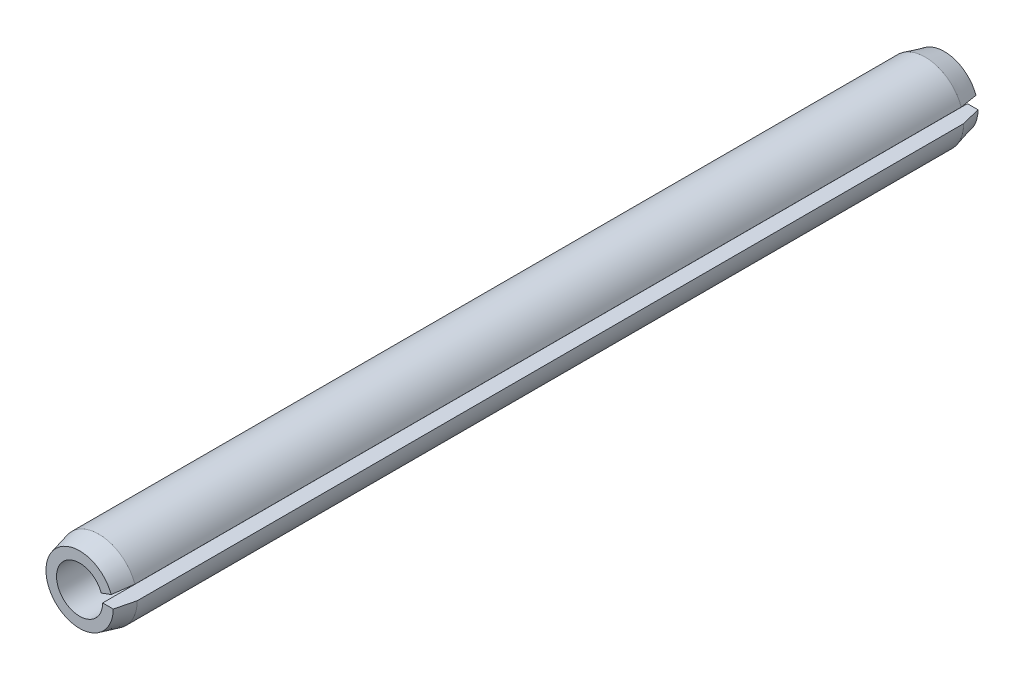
ISO-10303-21;
HEADER;
FILE_DESCRIPTION(('STEP AP214'),'2;1');
FILE_NAME('part.step','',(''),(''),'','','');
FILE_SCHEMA(('AUTOMOTIVE_DESIGN { 1 0 10303 214 1 1 1 1 }'));
ENDSEC;
DATA;
#1=APPLICATION_CONTEXT('core data for automotive mechanical design processes');
#2=APPLICATION_PROTOCOL_DEFINITION('international standard','automotive_design',2000,#1);
#3=PRODUCT_CONTEXT('',#1,'mechanical');
#4=PRODUCT('Part','Part','',(#3));
#5=PRODUCT_RELATED_PRODUCT_CATEGORY('part','',(#4));
#6=PRODUCT_DEFINITION_FORMATION('','',#4);
#7=PRODUCT_DEFINITION_CONTEXT('part definition',#1,'design');
#8=PRODUCT_DEFINITION('design','',#6,#7);
#9=PRODUCT_DEFINITION_SHAPE('','',#8);
#10=(LENGTH_UNIT() NAMED_UNIT(*) SI_UNIT(.MILLI.,.METRE.));
#11=(NAMED_UNIT(*) PLANE_ANGLE_UNIT() SI_UNIT($,.RADIAN.));
#12=(NAMED_UNIT(*) SI_UNIT($,.STERADIAN.) SOLID_ANGLE_UNIT());
#13=UNCERTAINTY_MEASURE_WITH_UNIT(LENGTH_MEASURE(1.E-05),#10,'distance_accuracy_value','');
#14=(GEOMETRIC_REPRESENTATION_CONTEXT(3) GLOBAL_UNCERTAINTY_ASSIGNED_CONTEXT((#13)) GLOBAL_UNIT_ASSIGNED_CONTEXT((#10,
#11,#12)) REPRESENTATION_CONTEXT('',''));
#15=CARTESIAN_POINT('',(0.,0.,0.));
#16=DIRECTION('',(0.,0.,1.));
#17=DIRECTION('',(1.,0.,0.));
#18=AXIS2_PLACEMENT_3D('',#15,#16,#17);
#19=CARTESIAN_POINT('',(0.,0.,45.));
#20=DIRECTION('',(0.,0.,-1.));
#21=DIRECTION('',(-1.,0.,0.));
#22=AXIS2_PLACEMENT_3D('',#19,#20,#21);
#23=CYLINDRICAL_SURFACE('',#22,1.2);
#24=CARTESIAN_POINT('',(0.,0.,0.));
#25=DIRECTION('',(0.,0.,-1.));
#26=DIRECTION('',(1.,0.,0.));
#27=AXIS2_PLACEMENT_3D('',#24,#25,#26);
#28=CIRCLE('',#27,1.2);
#29=CARTESIAN_POINT('',(1.2,0.,0.));
#30=VERTEX_POINT('',#29);
#31=CARTESIAN_POINT('',(1.12763114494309,0.410424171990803,0.));
#32=VERTEX_POINT('',#31);
#33=EDGE_CURVE('E104',#30,#32,#28,.T.);
#34=ORIENTED_EDGE('',*,*,#33,.T.);
#35=DIRECTION('',(0.,0.,-1.));
#36=VECTOR('',#35,1.);
#37=CARTESIAN_POINT('',(1.12763114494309,0.410424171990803,45.));
#38=LINE('',#37,#36);
#39=CARTESIAN_POINT('',(1.12763114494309,0.410424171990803,45.));
#40=VERTEX_POINT('',#39);
#41=EDGE_CURVE('E87',#40,#32,#38,.T.);
#42=ORIENTED_EDGE('',*,*,#41,.F.);
#43=CARTESIAN_POINT('',(0.,0.,45.));
#44=DIRECTION('',(0.,0.,-1.));
#45=DIRECTION('',(1.,0.,0.));
#46=AXIS2_PLACEMENT_3D('',#43,#44,#45);
#47=CIRCLE('',#46,1.2);
#48=CARTESIAN_POINT('',(1.2,0.,45.));
#49=VERTEX_POINT('',#48);
#50=EDGE_CURVE('E94',#49,#40,#47,.T.);
#51=ORIENTED_EDGE('',*,*,#50,.F.);
#52=DIRECTION('',(0.,0.,-1.));
#53=VECTOR('',#52,1.);
#54=CARTESIAN_POINT('',(1.2,0.,45.));
#55=LINE('',#54,#53);
#56=EDGE_CURVE('E125',#49,#30,#55,.T.);
#57=ORIENTED_EDGE('',*,*,#56,.T.);
#58=EDGE_LOOP('',(#34,#42,#51,#57));
#59=FACE_BOUND('',#58,.T.);
#60=ADVANCED_FACE('F31',(#59),#23,.F.);
#61=CARTESIAN_POINT('',(1.12763114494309,0.410424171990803,45.));
#62=DIRECTION('',(-0.342020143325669,0.939692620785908,0.));
#63=DIRECTION('',(-0.939692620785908,-0.342020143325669,0.));
#64=AXIS2_PLACEMENT_3D('',#61,#62,#63);
#65=PLANE('',#64);
#66=DIRECTION('',(0.,0.,-1.));
#67=VECTOR('',#66,1.);
#68=CARTESIAN_POINT('',(1.87938524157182,0.684040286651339,45.));
#69=LINE('',#68,#67);
#70=CARTESIAN_POINT('',(1.87938524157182,0.68404028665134,44.0000000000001));
#71=VERTEX_POINT('',#70);
#72=CARTESIAN_POINT('',(1.87938524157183,0.684040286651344,1.0000000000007));
#73=VERTEX_POINT('',#72);
#74=EDGE_CURVE('E106',#71,#73,#69,.T.);
#75=ORIENTED_EDGE('',*,*,#74,.F.);
#76=DIRECTION('',(0.227908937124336,0.0829520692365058,-0.970142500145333));
#77=VECTOR('',#76,1.);
#78=CARTESIAN_POINT('',(0.,0.,52.0000000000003));
#79=LINE('',#78,#77);
#80=CARTESIAN_POINT('',(1.64446208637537,0.598535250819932,45.));
#81=VERTEX_POINT('',#80);
#82=EDGE_CURVE('E11',#71,#81,#79,.F.);
#83=ORIENTED_EDGE('',*,*,#82,.T.);
#84=DIRECTION('',(0.939692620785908,0.342020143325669,0.));
#85=VECTOR('',#84,1.);
#86=CARTESIAN_POINT('',(1.12763114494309,0.410424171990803,45.));
#87=LINE('',#86,#85);
#88=EDGE_CURVE('E82',#40,#81,#87,.T.);
#89=ORIENTED_EDGE('',*,*,#88,.F.);
#90=ORIENTED_EDGE('',*,*,#41,.T.);
#91=DIRECTION('',(0.939692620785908,0.342020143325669,0.));
#92=VECTOR('',#91,1.);
#93=CARTESIAN_POINT('',(1.12763114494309,0.410424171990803,0.));
#94=LINE('',#93,#92);
#95=CARTESIAN_POINT('',(1.6444620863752,0.598535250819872,0.));
#96=VERTEX_POINT('',#95);
#97=EDGE_CURVE('E130',#32,#96,#94,.T.);
#98=ORIENTED_EDGE('',*,*,#97,.T.);
#99=DIRECTION('',(-0.227908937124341,-0.0829520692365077,-0.970142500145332));
#100=VECTOR('',#99,1.);
#101=CARTESIAN_POINT('',(0.,0.,-6.99999999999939));
#102=LINE('',#101,#100);
#103=EDGE_CURVE('E118',#96,#73,#102,.F.);
#104=ORIENTED_EDGE('',*,*,#103,.T.);
#105=EDGE_LOOP('',(#75,#83,#89,#90,#98,#104));
#106=FACE_BOUND('',#105,.T.);
#107=ADVANCED_FACE('F84',(#106),#65,.F.);
#108=CARTESIAN_POINT('',(0.,0.,45.));
#109=DIRECTION('',(0.,0.,-1.));
#110=DIRECTION('',(-1.,0.,0.));
#111=AXIS2_PLACEMENT_3D('',#108,#109,#110);
#112=CYLINDRICAL_SURFACE('',#111,2.);
#113=DIRECTION('',(0.,0.,-1.));
#114=VECTOR('',#113,1.);
#115=CARTESIAN_POINT('',(2.,0.,45.));
#116=LINE('',#115,#114);
#117=CARTESIAN_POINT('',(2.,0.,44.0000000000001));
#118=VERTEX_POINT('',#117);
#119=CARTESIAN_POINT('',(1.99999999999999,0.,1.00000000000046));
#120=VERTEX_POINT('',#119);
#121=EDGE_CURVE('E111',#118,#120,#116,.T.);
#122=ORIENTED_EDGE('',*,*,#121,.F.);
#123=CARTESIAN_POINT('',(0.,0.,44.0000000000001));
#124=DIRECTION('',(0.,0.,1.));
#125=DIRECTION('',(1.,0.,0.));
#126=AXIS2_PLACEMENT_3D('',#123,#124,#125);
#127=CIRCLE('',#126,2.);
#128=EDGE_CURVE('E39',#118,#71,#127,.F.);
#129=ORIENTED_EDGE('',*,*,#128,.T.);
#130=ORIENTED_EDGE('',*,*,#74,.T.);
#131=CARTESIAN_POINT('',(0.,0.,1.00000000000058));
#132=DIRECTION('',(0.,0.,1.));
#133=DIRECTION('',(1.,0.,0.));
#134=AXIS2_PLACEMENT_3D('',#131,#132,#133);
#135=CIRCLE('',#134,2.);
#136=EDGE_CURVE('E105',#73,#120,#135,.T.);
#137=ORIENTED_EDGE('',*,*,#136,.T.);
#138=EDGE_LOOP('',(#122,#129,#130,#137));
#139=FACE_BOUND('',#138,.T.);
#140=ADVANCED_FACE('F139',(#139),#112,.T.);
#141=CARTESIAN_POINT('',(1.2,0.,45.));
#142=DIRECTION('',(0.,-1.,0.));
#143=DIRECTION('',(0.,0.,-1.));
#144=AXIS2_PLACEMENT_3D('',#141,#142,#143);
#145=PLANE('',#144);
#146=DIRECTION('',(-1.,0.,0.));
#147=VECTOR('',#146,1.);
#148=CARTESIAN_POINT('',(1.2,0.,45.));
#149=LINE('',#148,#147);
#150=CARTESIAN_POINT('',(1.75000000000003,0.,45.));
#151=VERTEX_POINT('',#150);
#152=EDGE_CURVE('E93',#151,#49,#149,.T.);
#153=ORIENTED_EDGE('',*,*,#152,.F.);
#154=DIRECTION('',(-0.242535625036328,0.,0.970142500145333));
#155=VECTOR('',#154,1.);
#156=CARTESIAN_POINT('',(0.,0.,52.0000000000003));
#157=LINE('',#156,#155);
#158=EDGE_CURVE('E53',#151,#118,#157,.F.);
#159=ORIENTED_EDGE('',*,*,#158,.T.);
#160=ORIENTED_EDGE('',*,*,#121,.T.);
#161=DIRECTION('',(0.242535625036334,0.,0.970142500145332));
#162=VECTOR('',#161,1.);
#163=CARTESIAN_POINT('',(0.,0.,-6.99999999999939));
#164=LINE('',#163,#162);
#165=CARTESIAN_POINT('',(1.74999999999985,0.,0.));
#166=VERTEX_POINT('',#165);
#167=EDGE_CURVE('E109',#120,#166,#164,.F.);
#168=ORIENTED_EDGE('',*,*,#167,.T.);
#169=DIRECTION('',(-1.,0.,0.));
#170=VECTOR('',#169,1.);
#171=CARTESIAN_POINT('',(1.2,0.,0.));
#172=LINE('',#171,#170);
#173=EDGE_CURVE('E101',#166,#30,#172,.T.);
#174=ORIENTED_EDGE('',*,*,#173,.T.);
#175=ORIENTED_EDGE('',*,*,#56,.F.);
#176=EDGE_LOOP('',(#153,#159,#160,#168,#174,#175));
#177=FACE_BOUND('',#176,.T.);
#178=ADVANCED_FACE('F124',(#177),#145,.F.);
#179=CARTESIAN_POINT('',(0.,0.,45.));
#180=DIRECTION('',(0.,0.,1.));
#181=DIRECTION('',(1.,0.,0.));
#182=AXIS2_PLACEMENT_3D('',#179,#180,#181);
#183=PLANE('',#182);
#184=ORIENTED_EDGE('',*,*,#88,.T.);
#185=CARTESIAN_POINT('',(0.,0.,45.));
#186=DIRECTION('',(0.,0.,1.));
#187=DIRECTION('',(1.,0.,0.));
#188=AXIS2_PLACEMENT_3D('',#185,#186,#187);
#189=CIRCLE('',#188,1.75000000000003);
#190=EDGE_CURVE('E121',#81,#151,#189,.T.);
#191=ORIENTED_EDGE('',*,*,#190,.T.);
#192=ORIENTED_EDGE('',*,*,#152,.T.);
#193=ORIENTED_EDGE('',*,*,#50,.T.);
#194=EDGE_LOOP('',(#184,#191,#192,#193));
#195=FACE_BOUND('',#194,.T.);
#196=ADVANCED_FACE('F97',(#195),#183,.T.);
#197=CARTESIAN_POINT('',(0.,0.,0.));
#198=DIRECTION('',(0.,0.,1.));
#199=DIRECTION('',(1.,0.,0.));
#200=AXIS2_PLACEMENT_3D('',#197,#198,#199);
#201=PLANE('',#200);
#202=ORIENTED_EDGE('',*,*,#173,.F.);
#203=CARTESIAN_POINT('',(0.,0.,0.));
#204=DIRECTION('',(0.,0.,1.));
#205=DIRECTION('',(1.,0.,0.));
#206=AXIS2_PLACEMENT_3D('',#203,#204,#205);
#207=CIRCLE('',#206,1.74999999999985);
#208=EDGE_CURVE('E116',#166,#96,#207,.F.);
#209=ORIENTED_EDGE('',*,*,#208,.T.);
#210=ORIENTED_EDGE('',*,*,#97,.F.);
#211=ORIENTED_EDGE('',*,*,#33,.F.);
#212=EDGE_LOOP('',(#202,#209,#210,#211));
#213=FACE_BOUND('',#212,.T.);
#214=ADVANCED_FACE('F141',(#213),#201,.F.);
#215=CARTESIAN_POINT('',(0.,0.,1.00000000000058));
#216=DIRECTION('',(0.,0.,1.));
#217=DIRECTION('',(1.,0.,0.));
#218=AXIS2_PLACEMENT_3D('',#215,#216,#217);
#219=CONICAL_SURFACE('',#218,2.,0.244978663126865);
#220=ORIENTED_EDGE('',*,*,#103,.F.);
#221=ORIENTED_EDGE('',*,*,#208,.F.);
#222=ORIENTED_EDGE('',*,*,#167,.F.);
#223=ORIENTED_EDGE('',*,*,#136,.F.);
#224=EDGE_LOOP('',(#220,#221,#222,#223));
#225=FACE_BOUND('',#224,.T.);
#226=ADVANCED_FACE('F138',(#225),#219,.T.);
#227=CARTESIAN_POINT('',(0.,0.,45.));
#228=DIRECTION('',(0.,0.,-1.));
#229=DIRECTION('',(-1.,0.,0.));
#230=AXIS2_PLACEMENT_3D('',#227,#228,#229);
#231=CONICAL_SURFACE('',#230,1.75000000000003,0.244978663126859);
#232=ORIENTED_EDGE('',*,*,#82,.F.);
#233=ORIENTED_EDGE('',*,*,#128,.F.);
#234=ORIENTED_EDGE('',*,*,#158,.F.);
#235=ORIENTED_EDGE('',*,*,#190,.F.);
#236=EDGE_LOOP('',(#232,#233,#234,#235));
#237=FACE_BOUND('',#236,.T.);
#238=ADVANCED_FACE('F33',(#237),#231,.T.);
#239=CLOSED_SHELL('',(#60,#107,#140,#178,#196,#214,#226,#238));
#240=MANIFOLD_SOLID_BREP('B2',#239);
#241=ADVANCED_BREP_SHAPE_REPRESENTATION('',(#18,#240),#14);
#242=SHAPE_DEFINITION_REPRESENTATION(#9,#241);
ENDSEC;
END-ISO-10303-21;
